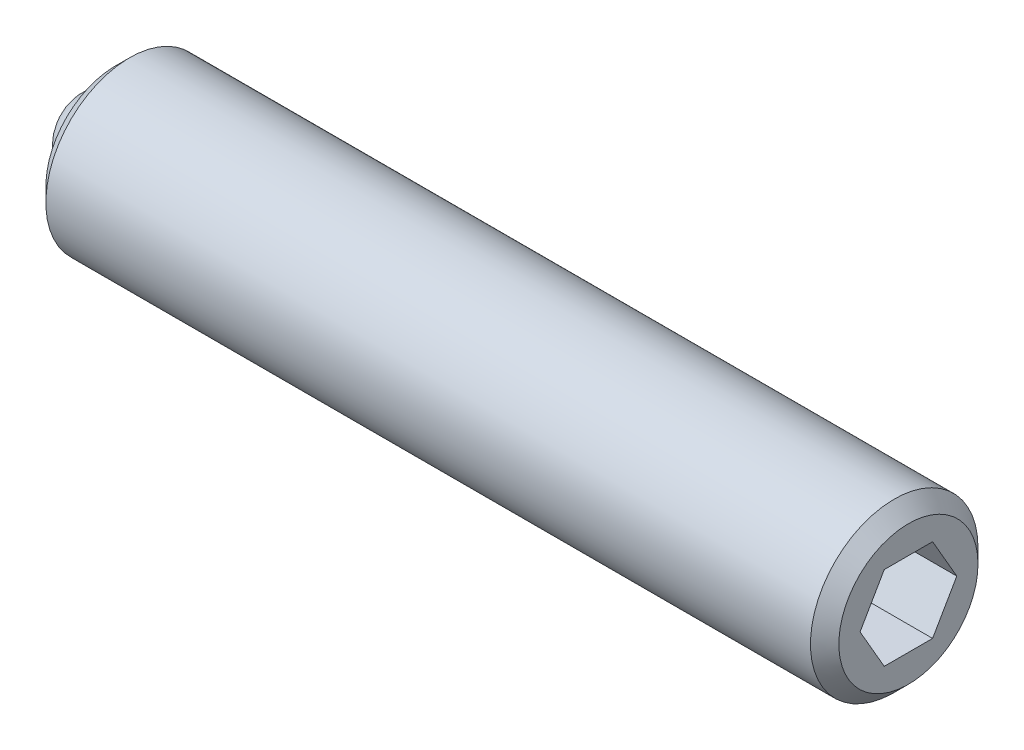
ISO-10303-21;
HEADER;
FILE_DESCRIPTION(('STEP AP214'),'2;1');
FILE_NAME('part.step','',(''),(''),'','','');
FILE_SCHEMA(('AUTOMOTIVE_DESIGN { 1 0 10303 214 1 1 1 1 }'));
ENDSEC;
DATA;
#1=APPLICATION_CONTEXT('core data for automotive mechanical design processes');
#2=APPLICATION_PROTOCOL_DEFINITION('international standard','automotive_design',2000,#1);
#3=PRODUCT_CONTEXT('',#1,'mechanical');
#4=PRODUCT('Part','Part','',(#3));
#5=PRODUCT_RELATED_PRODUCT_CATEGORY('part','',(#4));
#6=PRODUCT_DEFINITION_FORMATION('','',#4);
#7=PRODUCT_DEFINITION_CONTEXT('part definition',#1,'design');
#8=PRODUCT_DEFINITION('design','',#6,#7);
#9=PRODUCT_DEFINITION_SHAPE('','',#8);
#10=(LENGTH_UNIT() NAMED_UNIT(*) SI_UNIT(.MILLI.,.METRE.));
#11=(NAMED_UNIT(*) PLANE_ANGLE_UNIT() SI_UNIT($,.RADIAN.));
#12=(NAMED_UNIT(*) SI_UNIT($,.STERADIAN.) SOLID_ANGLE_UNIT());
#13=UNCERTAINTY_MEASURE_WITH_UNIT(LENGTH_MEASURE(1.E-05),#10,'distance_accuracy_value','');
#14=(GEOMETRIC_REPRESENTATION_CONTEXT(3) GLOBAL_UNCERTAINTY_ASSIGNED_CONTEXT((#13)) GLOBAL_UNIT_ASSIGNED_CONTEXT((#10,
#11,#12)) REPRESENTATION_CONTEXT('',''));
#15=CARTESIAN_POINT('',(0.,0.,0.));
#16=DIRECTION('',(0.,0.,1.));
#17=DIRECTION('',(1.,0.,0.));
#18=AXIS2_PLACEMENT_3D('',#15,#16,#17);
#19=CARTESIAN_POINT('',(0.,0.,0.));
#20=DIRECTION('',(0.,-1.,0.));
#21=DIRECTION('',(0.,0.,-1.));
#22=AXIS2_PLACEMENT_3D('',#19,#20,#21);
#23=SPHERICAL_SURFACE('',#22,0.8);
#24=CARTESIAN_POINT('',(0.,-0.8,0.));
#25=VERTEX_POINT('',#24);
#26=VERTEX_LOOP('',#25);
#27=FACE_BOUND('',#26,.T.);
#28=ADVANCED_FACE('F41',(#27),#23,.T.);
#29=CLOSED_SHELL('',(#28));
#30=MANIFOLD_SOLID_BREP('B2',#29);
#31=CARTESIAN_POINT('',(14.2,0.,0.));
#32=DIRECTION('',(-1.,0.,0.));
#33=DIRECTION('',(0.,0.,1.));
#34=AXIS2_PLACEMENT_3D('',#31,#32,#33);
#35=CYLINDRICAL_SURFACE('',#34,1.5);
#36=CARTESIAN_POINT('',(13.946,0.,0.));
#37=DIRECTION('',(1.,0.,0.));
#38=DIRECTION('',(0.,0.,-1.));
#39=AXIS2_PLACEMENT_3D('',#36,#37,#38);
#40=CIRCLE('',#39,1.5);
#41=CARTESIAN_POINT('',(13.946,0.,-1.5));
#42=VERTEX_POINT('',#41);
#43=EDGE_CURVE('E39',#42,#42,#40,.F.);
#44=ORIENTED_EDGE('',*,*,#43,.T.);
#45=EDGE_LOOP('',(#44));
#46=FACE_BOUND('',#45,.T.);
#47=CARTESIAN_POINT('',(0.254000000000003,0.,0.));
#48=DIRECTION('',(1.,0.,0.));
#49=DIRECTION('',(0.,0.,-1.));
#50=AXIS2_PLACEMENT_3D('',#47,#48,#49);
#51=CIRCLE('',#50,1.5);
#52=CARTESIAN_POINT('',(0.254000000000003,0.,-1.5));
#53=VERTEX_POINT('',#52);
#54=EDGE_CURVE('E176',#53,#53,#51,.T.);
#55=ORIENTED_EDGE('',*,*,#54,.T.);
#56=EDGE_LOOP('',(#55));
#57=FACE_BOUND('',#56,.T.);
#58=ADVANCED_FACE('F54',(#46,#57),#35,.T.);
#59=CARTESIAN_POINT('',(14.2,0.,0.));
#60=DIRECTION('',(1.,0.,0.));
#61=DIRECTION('',(0.,0.,-1.));
#62=AXIS2_PLACEMENT_3D('',#59,#60,#61);
#63=PLANE('',#62);
#64=DIRECTION('',(0.,0.866025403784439,-0.5));
#65=VECTOR('',#64,1.);
#66=CARTESIAN_POINT('',(14.2,-0.75,-0.43301270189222));
#67=LINE('',#66,#65);
#68=CARTESIAN_POINT('',(14.2,-0.75,-0.43301270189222));
#69=VERTEX_POINT('',#68);
#70=CARTESIAN_POINT('',(14.2,0.,-0.866025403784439));
#71=VERTEX_POINT('',#70);
#72=EDGE_CURVE('E77',#69,#71,#67,.T.);
#73=ORIENTED_EDGE('',*,*,#72,.F.);
#74=DIRECTION('',(0.,0.,-1.));
#75=VECTOR('',#74,1.);
#76=CARTESIAN_POINT('',(14.2,-0.75,0.433012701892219));
#77=LINE('',#76,#75);
#78=CARTESIAN_POINT('',(14.2,-0.75,0.433012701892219));
#79=VERTEX_POINT('',#78);
#80=EDGE_CURVE('E143',#79,#69,#77,.T.);
#81=ORIENTED_EDGE('',*,*,#80,.F.);
#82=DIRECTION('',(0.,-0.866025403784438,-0.5));
#83=VECTOR('',#82,1.);
#84=CARTESIAN_POINT('',(14.2,0.,0.866025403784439));
#85=LINE('',#84,#83);
#86=CARTESIAN_POINT('',(14.2,0.,0.866025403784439));
#87=VERTEX_POINT('',#86);
#88=EDGE_CURVE('E169',#87,#79,#85,.T.);
#89=ORIENTED_EDGE('',*,*,#88,.F.);
#90=DIRECTION('',(0.,-0.866025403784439,0.5));
#91=VECTOR('',#90,1.);
#92=CARTESIAN_POINT('',(14.2,0.75,0.433012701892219));
#93=LINE('',#92,#91);
#94=CARTESIAN_POINT('',(14.2,0.75,0.433012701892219));
#95=VERTEX_POINT('',#94);
#96=EDGE_CURVE('E166',#95,#87,#93,.T.);
#97=ORIENTED_EDGE('',*,*,#96,.F.);
#98=DIRECTION('',(0.,0.,1.));
#99=VECTOR('',#98,1.);
#100=CARTESIAN_POINT('',(14.2,0.75,-0.433012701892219));
#101=LINE('',#100,#99);
#102=CARTESIAN_POINT('',(14.2,0.75,-0.433012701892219));
#103=VERTEX_POINT('',#102);
#104=EDGE_CURVE('E163',#103,#95,#101,.T.);
#105=ORIENTED_EDGE('',*,*,#104,.F.);
#106=DIRECTION('',(0.,0.866025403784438,0.5));
#107=VECTOR('',#106,1.);
#108=CARTESIAN_POINT('',(14.2,0.,-0.866025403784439));
#109=LINE('',#108,#107);
#110=EDGE_CURVE('E160',#71,#103,#109,.T.);
#111=ORIENTED_EDGE('',*,*,#110,.F.);
#112=EDGE_LOOP('',(#73,#81,#89,#97,#105,#111));
#113=FACE_BOUND('',#112,.T.);
#114=CARTESIAN_POINT('',(14.2,0.,0.));
#115=DIRECTION('',(1.,0.,0.));
#116=DIRECTION('',(0.,0.,-1.));
#117=AXIS2_PLACEMENT_3D('',#114,#115,#116);
#118=CIRCLE('',#117,1.246);
#119=CARTESIAN_POINT('',(14.2,0.,-1.246));
#120=VERTEX_POINT('',#119);
#121=EDGE_CURVE('E62',#120,#120,#118,.T.);
#122=ORIENTED_EDGE('',*,*,#121,.T.);
#123=EDGE_LOOP('',(#122));
#124=FACE_BOUND('',#123,.T.);
#125=ADVANCED_FACE('F193',(#113,#124),#63,.T.);
#126=CARTESIAN_POINT('',(0.,0.,0.));
#127=DIRECTION('',(1.,0.,0.));
#128=DIRECTION('',(0.,0.,-1.));
#129=AXIS2_PLACEMENT_3D('',#126,#127,#128);
#130=PLANE('',#129);
#131=CARTESIAN_POINT('',(0.,0.,0.));
#132=DIRECTION('',(-1.,0.,0.));
#133=DIRECTION('',(0.,0.,1.));
#134=AXIS2_PLACEMENT_3D('',#131,#132,#133);
#135=CIRCLE('',#134,0.8);
#136=CARTESIAN_POINT('',(0.,0.79747984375,-0.0634499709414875));
#137=VERTEX_POINT('',#136);
#138=CARTESIAN_POINT('',(0.,0.79747984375,0.0634499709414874));
#139=VERTEX_POINT('',#138);
#140=EDGE_CURVE('E128',#137,#139,#135,.T.);
#141=ORIENTED_EDGE('',*,*,#140,.F.);
#142=CARTESIAN_POINT('',(0.,0.8,0.));
#143=DIRECTION('',(-1.,0.,0.));
#144=DIRECTION('',(0.,0.,1.));
#145=AXIS2_PLACEMENT_3D('',#142,#143,#144);
#146=CIRCLE('',#145,0.0635000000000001);
#147=EDGE_CURVE('E117',#139,#137,#146,.T.);
#148=ORIENTED_EDGE('',*,*,#147,.F.);
#149=EDGE_LOOP('',(#141,#148));
#150=FACE_BOUND('',#149,.T.);
#151=CARTESIAN_POINT('',(0.,0.,0.));
#152=DIRECTION('',(1.,0.,0.));
#153=DIRECTION('',(0.,0.,-1.));
#154=AXIS2_PLACEMENT_3D('',#151,#152,#153);
#155=CIRCLE('',#154,1.246);
#156=CARTESIAN_POINT('',(0.,0.,-1.246));
#157=VERTEX_POINT('',#156);
#158=EDGE_CURVE('E188',#157,#157,#155,.F.);
#159=ORIENTED_EDGE('',*,*,#158,.T.);
#160=EDGE_LOOP('',(#159));
#161=FACE_BOUND('',#160,.T.);
#162=ADVANCED_FACE('F132',(#150,#161),#130,.F.);
#163=CARTESIAN_POINT('',(0.254000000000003,0.,0.));
#164=DIRECTION('',(1.,0.,0.));
#165=DIRECTION('',(0.,0.,-1.));
#166=AXIS2_PLACEMENT_3D('',#163,#164,#165);
#167=CONICAL_SURFACE('',#166,1.5,0.785398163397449);
#168=ORIENTED_EDGE('',*,*,#158,.F.);
#169=EDGE_LOOP('',(#168));
#170=FACE_BOUND('',#169,.T.);
#171=ORIENTED_EDGE('',*,*,#54,.F.);
#172=EDGE_LOOP('',(#171));
#173=FACE_BOUND('',#172,.T.);
#174=ADVANCED_FACE('F197',(#170,#173),#167,.T.);
#175=CARTESIAN_POINT('',(14.2,0.,0.));
#176=DIRECTION('',(-1.,0.,0.));
#177=DIRECTION('',(0.,0.,1.));
#178=AXIS2_PLACEMENT_3D('',#175,#176,#177);
#179=CONICAL_SURFACE('',#178,1.246,0.78539816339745);
#180=ORIENTED_EDGE('',*,*,#43,.F.);
#181=EDGE_LOOP('',(#180));
#182=FACE_BOUND('',#181,.T.);
#183=ORIENTED_EDGE('',*,*,#121,.F.);
#184=EDGE_LOOP('',(#183));
#185=FACE_BOUND('',#184,.T.);
#186=ADVANCED_FACE('F56',(#182,#185),#179,.T.);
#187=CARTESIAN_POINT('',(12.2,-0.75,-0.43301270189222));
#188=DIRECTION('',(0.,-0.5,-0.866025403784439));
#189=DIRECTION('',(0.,0.866025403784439,-0.5));
#190=AXIS2_PLACEMENT_3D('',#187,#188,#189);
#191=PLANE('',#190);
#192=ORIENTED_EDGE('',*,*,#72,.T.);
#193=DIRECTION('',(1.,0.,0.));
#194=VECTOR('',#193,1.);
#195=CARTESIAN_POINT('',(12.2,0.,-0.866025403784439));
#196=LINE('',#195,#194);
#197=CARTESIAN_POINT('',(12.2,0.,-0.866025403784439));
#198=VERTEX_POINT('',#197);
#199=EDGE_CURVE('E158',#198,#71,#196,.T.);
#200=ORIENTED_EDGE('',*,*,#199,.F.);
#201=DIRECTION('',(0.,0.866025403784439,-0.5));
#202=VECTOR('',#201,1.);
#203=CARTESIAN_POINT('',(12.2,-0.75,-0.43301270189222));
#204=LINE('',#203,#202);
#205=CARTESIAN_POINT('',(12.2,-0.75,-0.43301270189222));
#206=VERTEX_POINT('',#205);
#207=EDGE_CURVE('E139',#206,#198,#204,.T.);
#208=ORIENTED_EDGE('',*,*,#207,.F.);
#209=DIRECTION('',(1.,0.,0.));
#210=VECTOR('',#209,1.);
#211=CARTESIAN_POINT('',(12.2,-0.75,-0.43301270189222));
#212=LINE('',#211,#210);
#213=EDGE_CURVE('E174',#206,#69,#212,.T.);
#214=ORIENTED_EDGE('',*,*,#213,.T.);
#215=EDGE_LOOP('',(#192,#200,#208,#214));
#216=FACE_BOUND('',#215,.T.);
#217=ADVANCED_FACE('F196',(#216),#191,.F.);
#218=CARTESIAN_POINT('',(12.2,-0.75,0.433012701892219));
#219=DIRECTION('',(0.,-1.,0.));
#220=DIRECTION('',(0.,0.,-1.));
#221=AXIS2_PLACEMENT_3D('',#218,#219,#220);
#222=PLANE('',#221);
#223=ORIENTED_EDGE('',*,*,#80,.T.);
#224=ORIENTED_EDGE('',*,*,#213,.F.);
#225=DIRECTION('',(0.,0.,-1.));
#226=VECTOR('',#225,1.);
#227=CARTESIAN_POINT('',(12.2,-0.75,0.433012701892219));
#228=LINE('',#227,#226);
#229=CARTESIAN_POINT('',(12.2,-0.75,0.433012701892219));
#230=VERTEX_POINT('',#229);
#231=EDGE_CURVE('E155',#230,#206,#228,.T.);
#232=ORIENTED_EDGE('',*,*,#231,.F.);
#233=DIRECTION('',(1.,0.,0.));
#234=VECTOR('',#233,1.);
#235=CARTESIAN_POINT('',(12.2,-0.75,0.433012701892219));
#236=LINE('',#235,#234);
#237=EDGE_CURVE('E177',#230,#79,#236,.T.);
#238=ORIENTED_EDGE('',*,*,#237,.T.);
#239=EDGE_LOOP('',(#223,#224,#232,#238));
#240=FACE_BOUND('',#239,.T.);
#241=ADVANCED_FACE('F203',(#240),#222,.F.);
#242=CARTESIAN_POINT('',(12.2,0.,0.866025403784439));
#243=DIRECTION('',(0.,-0.5,0.866025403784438));
#244=DIRECTION('',(0.,-0.866025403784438,-0.5));
#245=AXIS2_PLACEMENT_3D('',#242,#243,#244);
#246=PLANE('',#245);
#247=ORIENTED_EDGE('',*,*,#88,.T.);
#248=ORIENTED_EDGE('',*,*,#237,.F.);
#249=DIRECTION('',(0.,-0.866025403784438,-0.5));
#250=VECTOR('',#249,1.);
#251=CARTESIAN_POINT('',(12.2,0.,0.866025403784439));
#252=LINE('',#251,#250);
#253=CARTESIAN_POINT('',(12.2,0.,0.866025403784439));
#254=VERTEX_POINT('',#253);
#255=EDGE_CURVE('E152',#254,#230,#252,.T.);
#256=ORIENTED_EDGE('',*,*,#255,.F.);
#257=DIRECTION('',(1.,0.,0.));
#258=VECTOR('',#257,1.);
#259=CARTESIAN_POINT('',(12.2,0.,0.866025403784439));
#260=LINE('',#259,#258);
#261=EDGE_CURVE('E179',#254,#87,#260,.T.);
#262=ORIENTED_EDGE('',*,*,#261,.T.);
#263=EDGE_LOOP('',(#247,#248,#256,#262));
#264=FACE_BOUND('',#263,.T.);
#265=ADVANCED_FACE('F231',(#264),#246,.F.);
#266=CARTESIAN_POINT('',(12.2,0.75,0.433012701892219));
#267=DIRECTION('',(0.,0.5,0.866025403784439));
#268=DIRECTION('',(0.,-0.866025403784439,0.5));
#269=AXIS2_PLACEMENT_3D('',#266,#267,#268);
#270=PLANE('',#269);
#271=ORIENTED_EDGE('',*,*,#96,.T.);
#272=ORIENTED_EDGE('',*,*,#261,.F.);
#273=DIRECTION('',(0.,-0.866025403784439,0.5));
#274=VECTOR('',#273,1.);
#275=CARTESIAN_POINT('',(12.2,0.75,0.433012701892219));
#276=LINE('',#275,#274);
#277=CARTESIAN_POINT('',(12.2,0.75,0.433012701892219));
#278=VERTEX_POINT('',#277);
#279=EDGE_CURVE('E149',#278,#254,#276,.T.);
#280=ORIENTED_EDGE('',*,*,#279,.F.);
#281=DIRECTION('',(1.,0.,0.));
#282=VECTOR('',#281,1.);
#283=CARTESIAN_POINT('',(12.2,0.75,0.433012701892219));
#284=LINE('',#283,#282);
#285=EDGE_CURVE('E181',#278,#95,#284,.T.);
#286=ORIENTED_EDGE('',*,*,#285,.T.);
#287=EDGE_LOOP('',(#271,#272,#280,#286));
#288=FACE_BOUND('',#287,.T.);
#289=ADVANCED_FACE('F227',(#288),#270,.F.);
#290=CARTESIAN_POINT('',(12.2,0.75,-0.433012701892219));
#291=DIRECTION('',(0.,1.,0.));
#292=DIRECTION('',(0.,0.,1.));
#293=AXIS2_PLACEMENT_3D('',#290,#291,#292);
#294=PLANE('',#293);
#295=ORIENTED_EDGE('',*,*,#104,.T.);
#296=ORIENTED_EDGE('',*,*,#285,.F.);
#297=DIRECTION('',(0.,0.,1.));
#298=VECTOR('',#297,1.);
#299=CARTESIAN_POINT('',(12.2,0.75,-0.433012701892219));
#300=LINE('',#299,#298);
#301=CARTESIAN_POINT('',(12.2,0.75,-0.433012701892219));
#302=VERTEX_POINT('',#301);
#303=EDGE_CURVE('E146',#302,#278,#300,.T.);
#304=ORIENTED_EDGE('',*,*,#303,.F.);
#305=DIRECTION('',(1.,0.,0.));
#306=VECTOR('',#305,1.);
#307=CARTESIAN_POINT('',(12.2,0.75,-0.433012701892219));
#308=LINE('',#307,#306);
#309=EDGE_CURVE('E183',#302,#103,#308,.T.);
#310=ORIENTED_EDGE('',*,*,#309,.T.);
#311=EDGE_LOOP('',(#295,#296,#304,#310));
#312=FACE_BOUND('',#311,.T.);
#313=ADVANCED_FACE('F223',(#312),#294,.F.);
#314=CARTESIAN_POINT('',(12.2,0.,-0.866025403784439));
#315=DIRECTION('',(0.,0.500000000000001,-0.866025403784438));
#316=DIRECTION('',(0.,0.866025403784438,0.500000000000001));
#317=AXIS2_PLACEMENT_3D('',#314,#315,#316);
#318=PLANE('',#317);
#319=ORIENTED_EDGE('',*,*,#110,.T.);
#320=ORIENTED_EDGE('',*,*,#309,.F.);
#321=DIRECTION('',(0.,0.866025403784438,0.5));
#322=VECTOR('',#321,1.);
#323=CARTESIAN_POINT('',(12.2,0.,-0.866025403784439));
#324=LINE('',#323,#322);
#325=EDGE_CURVE('E142',#198,#302,#324,.T.);
#326=ORIENTED_EDGE('',*,*,#325,.F.);
#327=ORIENTED_EDGE('',*,*,#199,.T.);
#328=EDGE_LOOP('',(#319,#320,#326,#327));
#329=FACE_BOUND('',#328,.T.);
#330=ADVANCED_FACE('F219',(#329),#318,.F.);
#331=CARTESIAN_POINT('',(12.2,0.,0.));
#332=DIRECTION('',(1.,0.,0.));
#333=DIRECTION('',(0.,0.,-1.));
#334=AXIS2_PLACEMENT_3D('',#331,#332,#333);
#335=PLANE('',#334);
#336=ORIENTED_EDGE('',*,*,#207,.T.);
#337=ORIENTED_EDGE('',*,*,#325,.T.);
#338=ORIENTED_EDGE('',*,*,#303,.T.);
#339=ORIENTED_EDGE('',*,*,#279,.T.);
#340=ORIENTED_EDGE('',*,*,#255,.T.);
#341=ORIENTED_EDGE('',*,*,#231,.T.);
#342=EDGE_LOOP('',(#336,#337,#338,#339,#340,#341));
#343=FACE_BOUND('',#342,.T.);
#344=ADVANCED_FACE('F222',(#343),#335,.T.);
#345=CARTESIAN_POINT('',(0.8,0.,0.));
#346=DIRECTION('',(-1.,0.,0.));
#347=DIRECTION('',(0.,0.,1.));
#348=AXIS2_PLACEMENT_3D('',#345,#346,#347);
#349=CYLINDRICAL_SURFACE('',#348,0.8);
#350=CARTESIAN_POINT('',(0.8,0.,0.));
#351=DIRECTION('',(-1.,0.,0.));
#352=DIRECTION('',(0.,0.,1.));
#353=AXIS2_PLACEMENT_3D('',#350,#351,#352);
#354=CIRCLE('',#353,0.8);
#355=CARTESIAN_POINT('',(0.8,0.79747984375,-0.0634499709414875));
#356=VERTEX_POINT('',#355);
#357=CARTESIAN_POINT('',(0.8,0.79747984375,0.0634499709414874));
#358=VERTEX_POINT('',#357);
#359=EDGE_CURVE('E130',#356,#358,#354,.T.);
#360=ORIENTED_EDGE('',*,*,#359,.F.);
#361=DIRECTION('',(-1.,0.,0.));
#362=VECTOR('',#361,1.);
#363=CARTESIAN_POINT('',(0.94313511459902,0.79747984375,-0.0634499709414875));
#364=LINE('',#363,#362);
#365=EDGE_CURVE('E69',#356,#137,#364,.T.);
#366=ORIENTED_EDGE('',*,*,#365,.T.);
#367=ORIENTED_EDGE('',*,*,#140,.T.);
#368=DIRECTION('',(-1.,0.,0.));
#369=VECTOR('',#368,1.);
#370=CARTESIAN_POINT('',(0.94313511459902,0.79747984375,0.0634499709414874));
#371=LINE('',#370,#369);
#372=EDGE_CURVE('E120',#358,#139,#371,.T.);
#373=ORIENTED_EDGE('',*,*,#372,.F.);
#374=EDGE_LOOP('',(#360,#366,#367,#373));
#375=FACE_BOUND('',#374,.T.);
#376=ADVANCED_FACE('F127',(#375),#349,.F.);
#377=CARTESIAN_POINT('',(0.8,0.,0.));
#378=DIRECTION('',(-1.,0.,0.));
#379=DIRECTION('',(0.,0.,1.));
#380=AXIS2_PLACEMENT_3D('',#377,#378,#379);
#381=PLANE('',#380);
#382=ORIENTED_EDGE('',*,*,#359,.T.);
#383=CARTESIAN_POINT('',(0.8,0.8,0.));
#384=DIRECTION('',(-1.,0.,0.));
#385=DIRECTION('',(0.,0.,1.));
#386=AXIS2_PLACEMENT_3D('',#383,#384,#385);
#387=CIRCLE('',#386,0.0635000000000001);
#388=EDGE_CURVE('E134',#356,#358,#387,.F.);
#389=ORIENTED_EDGE('',*,*,#388,.F.);
#390=EDGE_LOOP('',(#382,#389));
#391=FACE_BOUND('',#390,.T.);
#392=ADVANCED_FACE('F244',(#391),#381,.T.);
#393=CARTESIAN_POINT('',(0.94313511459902,0.8,0.));
#394=DIRECTION('',(-1.,0.,0.));
#395=DIRECTION('',(0.,0.,1.));
#396=AXIS2_PLACEMENT_3D('',#393,#394,#395);
#397=CYLINDRICAL_SURFACE('',#396,0.0635000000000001);
#398=ORIENTED_EDGE('',*,*,#388,.T.);
#399=ORIENTED_EDGE('',*,*,#372,.T.);
#400=ORIENTED_EDGE('',*,*,#147,.T.);
#401=ORIENTED_EDGE('',*,*,#365,.F.);
#402=EDGE_LOOP('',(#398,#399,#400,#401));
#403=FACE_BOUND('',#402,.T.);
#404=ADVANCED_FACE('F118',(#403),#397,.F.);
#405=CLOSED_SHELL('',(#58,#125,#162,#174,#186,#217,#241,#265,#289,#313,#330,#344,#376,#392,#404));
#406=MANIFOLD_SOLID_BREP('B6',#405);
#407=ADVANCED_BREP_SHAPE_REPRESENTATION('',(#18,#30,#406),#14);
#408=SHAPE_DEFINITION_REPRESENTATION(#9,#407);
ENDSEC;
END-ISO-10303-21;
